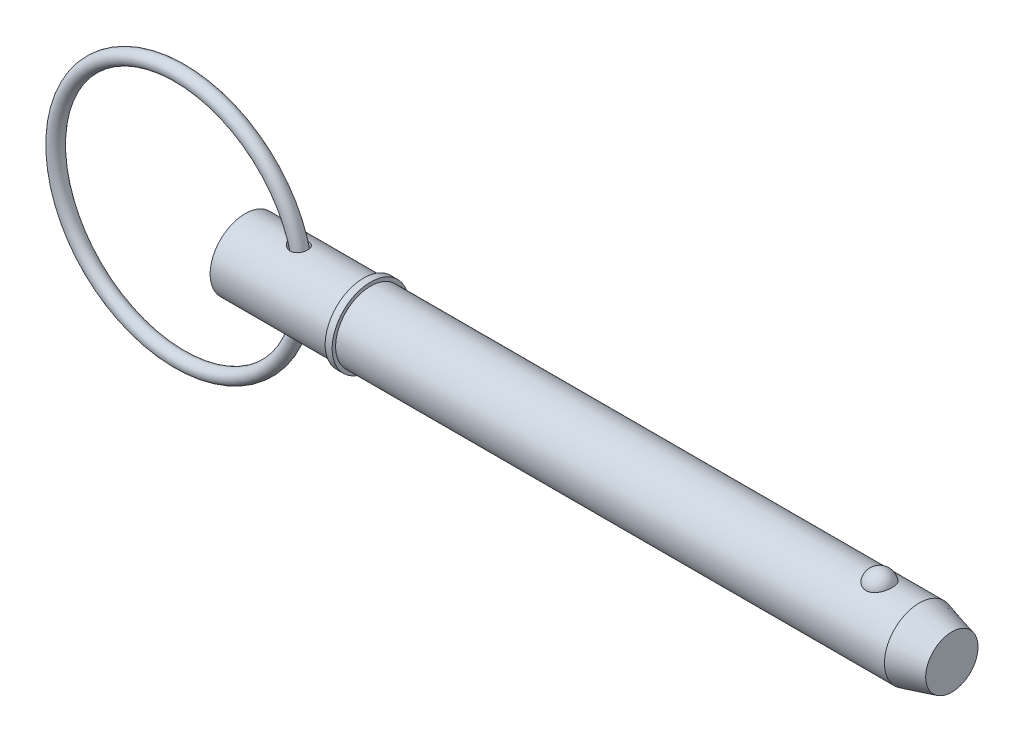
ISO-10303-21;
HEADER;
FILE_DESCRIPTION(('STEP AP214'),'2;1');
FILE_NAME('part.step','',(''),(''),'','','');
FILE_SCHEMA(('AUTOMOTIVE_DESIGN { 1 0 10303 214 1 1 1 1 }'));
ENDSEC;
DATA;
#1=APPLICATION_CONTEXT('core data for automotive mechanical design processes');
#2=APPLICATION_PROTOCOL_DEFINITION('international standard','automotive_design',2000,#1);
#3=PRODUCT_CONTEXT('',#1,'mechanical');
#4=PRODUCT('Part','Part','',(#3));
#5=PRODUCT_RELATED_PRODUCT_CATEGORY('part','',(#4));
#6=PRODUCT_DEFINITION_FORMATION('','',#4);
#7=PRODUCT_DEFINITION_CONTEXT('part definition',#1,'design');
#8=PRODUCT_DEFINITION('design','',#6,#7);
#9=PRODUCT_DEFINITION_SHAPE('','',#8);
#10=(LENGTH_UNIT() NAMED_UNIT(*) SI_UNIT(.MILLI.,.METRE.));
#11=(NAMED_UNIT(*) PLANE_ANGLE_UNIT() SI_UNIT($,.RADIAN.));
#12=(NAMED_UNIT(*) SI_UNIT($,.STERADIAN.) SOLID_ANGLE_UNIT());
#13=UNCERTAINTY_MEASURE_WITH_UNIT(LENGTH_MEASURE(1.E-05),#10,'distance_accuracy_value','');
#14=(GEOMETRIC_REPRESENTATION_CONTEXT(3) GLOBAL_UNCERTAINTY_ASSIGNED_CONTEXT((#13)) GLOBAL_UNIT_ASSIGNED_CONTEXT((#10,
#11,#12)) REPRESENTATION_CONTEXT('',''));
#15=CARTESIAN_POINT('',(0.,0.,0.));
#16=DIRECTION('',(0.,0.,1.));
#17=DIRECTION('',(1.,0.,0.));
#18=AXIS2_PLACEMENT_3D('',#15,#16,#17);
#19=CARTESIAN_POINT('',(-13.3805387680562,0.,0.));
#20=DIRECTION('',(0.,0.,1.));
#21=DIRECTION('',(1.,0.,0.));
#22=AXIS2_PLACEMENT_3D('',#19,#20,#21);
#23=TOROIDAL_SURFACE('',#22,25.4,1.429);
#24=CARTESIAN_POINT('',(13.4484612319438,0.,0.));
#25=VERTEX_POINT('',#24);
#26=VERTEX_LOOP('',#25);
#27=FACE_BOUND('',#26,.T.);
#28=ADVANCED_FACE('P0_F12',(#27),#23,.T.);
#29=CLOSED_SHELL('',(#28));
#30=MANIFOLD_SOLID_BREP('P0_B1',#29);
#31=CARTESIAN_POINT('',(0.,0.,0.));
#32=DIRECTION('',(1.,0.,0.));
#33=DIRECTION('',(0.,0.,-1.));
#34=AXIS2_PLACEMENT_3D('',#31,#32,#33);
#35=CYLINDRICAL_SURFACE('',#34,7.145);
#36=CARTESIAN_POINT('',(9.43029029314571,7.0820748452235,-0.94617170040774));
#37=CARTESIAN_POINT('',(9.49289741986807,7.07004660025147,-1.03619677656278));
#38=CARTESIAN_POINT('',(9.56370593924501,7.05703049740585,-1.12049617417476));
#39=CARTESIAN_POINT('',(9.71869321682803,7.03060933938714,-1.27585605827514));
#40=CARTESIAN_POINT('',(9.80290151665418,7.01720347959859,-1.34688652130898));
#41=CARTESIAN_POINT('',(9.98160385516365,6.99158714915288,-1.47408585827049));
#42=CARTESIAN_POINT('',(10.0760626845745,6.97937284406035,-1.53030346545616));
#43=CARTESIAN_POINT('',(10.2729508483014,6.95747410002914,-1.62697341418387));
#44=CARTESIAN_POINT('',(10.3753769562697,6.9477886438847,-1.66743209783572));
#45=CARTESIAN_POINT('',(10.5898946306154,6.93181594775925,-1.73266776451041));
#46=CARTESIAN_POINT('',(10.7022085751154,6.92567913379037,-1.75675727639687));
#47=CARTESIAN_POINT('',(10.9294935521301,6.91839634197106,-1.78523005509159));
#48=CARTESIAN_POINT('',(11.0444638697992,6.91724903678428,-1.78961856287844));
#49=CARTESIAN_POINT('',(11.2673249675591,6.92023954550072,-1.77801517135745));
#50=CARTESIAN_POINT('',(11.3752729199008,6.9241055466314,-1.7630715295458));
#51=CARTESIAN_POINT('',(11.5865707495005,6.93632220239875,-1.71437618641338));
#52=CARTESIAN_POINT('',(11.6899227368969,6.94467077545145,-1.68063321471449));
#53=CARTESIAN_POINT('',(11.8814537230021,6.96412118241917,-1.59802791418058));
#54=CARTESIAN_POINT('',(11.9701885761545,6.97498839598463,-1.55039425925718));
#55=CARTESIAN_POINT('',(12.1379548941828,6.99847346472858,-1.44066970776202));
#56=CARTESIAN_POINT('',(12.216987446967,7.01109112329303,-1.37858043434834));
#57=CARTESIAN_POINT('',(12.3614636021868,7.03632910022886,-1.24326778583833));
#58=CARTESIAN_POINT('',(12.4271729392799,7.04894297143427,-1.17032635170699));
#59=CARTESIAN_POINT('',(12.5455377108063,7.07306867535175,-1.01436746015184));
#60=CARTESIAN_POINT('',(12.5981928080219,7.08458047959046,-0.931349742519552));
#61=CARTESIAN_POINT('',(12.6896059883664,7.10535787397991,-0.756770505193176));
#62=CARTESIAN_POINT('',(12.7282356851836,7.11460247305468,-0.665139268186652));
#63=CARTESIAN_POINT('',(12.7900431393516,7.12971795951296,-0.476541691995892));
#64=CARTESIAN_POINT('',(12.8132203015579,7.13558871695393,-0.379575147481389));
#65=CARTESIAN_POINT('',(12.843715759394,7.14336270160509,-0.182249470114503));
#66=CARTESIAN_POINT('',(12.8509095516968,7.14523477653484,-0.081869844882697));
#67=CARTESIAN_POINT('',(12.8489064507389,7.14471772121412,0.118715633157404));
#68=CARTESIAN_POINT('',(12.8397092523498,7.14232851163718,0.218921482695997));
#69=CARTESIAN_POINT('',(12.8051110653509,7.13353949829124,0.41644658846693));
#70=CARTESIAN_POINT('',(12.7796895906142,7.12713462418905,0.513762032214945));
#71=CARTESIAN_POINT('',(12.7132079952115,7.1110024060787,0.702607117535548));
#72=CARTESIAN_POINT('',(12.6721476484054,7.10127501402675,0.79413667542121));
#73=CARTESIAN_POINT('',(12.5754142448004,7.07957648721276,0.968687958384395));
#74=CARTESIAN_POINT('',(12.5197583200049,7.06760798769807,1.05171950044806));
#75=CARTESIAN_POINT('',(12.3951873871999,7.04275315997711,1.20699878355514));
#76=CARTESIAN_POINT('',(12.3262733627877,7.02986689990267,1.27924732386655));
#77=CARTESIAN_POINT('',(12.1775943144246,7.00473797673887,1.41035599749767));
#78=CARTESIAN_POINT('',(12.0979195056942,6.99249102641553,1.46931758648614));
#79=CARTESIAN_POINT('',(11.9295314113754,6.96991222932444,1.57295053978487));
#80=CARTESIAN_POINT('',(11.840819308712,6.9595801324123,1.61762377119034));
#81=CARTESIAN_POINT('',(11.6577653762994,6.9420462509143,1.69128599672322));
#82=CARTESIAN_POINT('',(11.5634812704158,6.93481718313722,1.72041226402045));
#83=CARTESIAN_POINT('',(11.3712731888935,6.92407027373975,1.76316901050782));
#84=CARTESIAN_POINT('',(11.2733489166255,6.92055273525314,1.7767982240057));
#85=CARTESIAN_POINT('',(11.0745092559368,6.91745053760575,1.78883853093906));
#86=CARTESIAN_POINT('',(10.9735737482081,6.91794816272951,1.7869312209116));
#87=CARTESIAN_POINT('',(10.7732766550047,6.92286647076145,1.76777696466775));
#88=CARTESIAN_POINT('',(10.6739155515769,6.92728833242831,1.75052540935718));
#89=CARTESIAN_POINT('',(10.4726907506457,6.93987626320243,1.69995986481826));
#90=CARTESIAN_POINT('',(10.3710860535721,6.94826759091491,1.66567223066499));
#91=CARTESIAN_POINT('',(10.1746512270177,6.96783543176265,1.5818155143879));
#92=CARTESIAN_POINT('',(10.0798244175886,6.97901329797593,1.53223900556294));
#93=CARTESIAN_POINT('',(9.89353725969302,7.00369413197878,1.41530336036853));
#94=CARTESIAN_POINT('',(9.80266896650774,7.01729943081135,1.34701798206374));
#95=CARTESIAN_POINT('',(9.63408859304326,7.0446567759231,1.19571433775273));
#96=CARTESIAN_POINT('',(9.55637809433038,7.05840883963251,1.11269430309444));
#97=CARTESIAN_POINT('',(9.41909992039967,7.083998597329,0.935821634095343));
#98=CARTESIAN_POINT('',(9.35912834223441,7.09587546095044,0.842290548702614));
#99=CARTESIAN_POINT('',(9.25811978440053,7.11649414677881,0.645207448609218));
#100=CARTESIAN_POINT('',(9.21705789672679,7.12524008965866,0.541668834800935));
#101=CARTESIAN_POINT('',(9.16044503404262,7.13745944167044,0.341322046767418));
#102=CARTESIAN_POINT('',(9.14237352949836,7.14144984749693,0.245257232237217));
#103=CARTESIAN_POINT('',(9.12416132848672,7.14547143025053,0.0513577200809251));
#104=CARTESIAN_POINT('',(9.12401221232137,7.14550446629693,-0.0464761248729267));
#105=CARTESIAN_POINT('',(9.14075660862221,7.14180686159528,-0.230866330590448));
#106=CARTESIAN_POINT('',(9.15598246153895,7.13844450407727,-0.317588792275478));
#107=CARTESIAN_POINT('',(9.20015637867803,7.1288735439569,-0.487231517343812));
#108=CARTESIAN_POINT('',(9.22909411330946,7.12266708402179,-0.570154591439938));
#109=CARTESIAN_POINT('',(9.2869632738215,7.11060500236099,-0.702183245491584));
#110=CARTESIAN_POINT('',(9.3123377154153,7.10538970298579,-0.752949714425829));
#111=CARTESIAN_POINT('',(9.36784352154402,7.09422889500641,-0.851709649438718));
#112=CARTESIAN_POINT('',(9.39797435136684,7.08828346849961,-0.899703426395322));
#113=CARTESIAN_POINT('',(9.43029029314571,7.0820748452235,-0.94617170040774));
#114=B_SPLINE_CURVE_WITH_KNOTS('',3,(#36,#37,#38,#39,#40,#41,#42,#43,#44,#45,#46,#47,#48,#49,
#50,#51,#52,#53,#54,#55,#56,#57,#58,#59,#60,#61,#62,#63,#64,#65,#66,#67,#68,#69,#70,#71,#72,#73,
#74,#75,#76,#77,#78,#79,#80,#81,#82,#83,#84,#85,#86,#87,#88,#89,#90,#91,#92,#93,#94,#95,#96,#97,
#98,#99,#100,#101,#102,#103,#104,#105,#106,#107,#108,#109,#110,#111,#112,#113),.UNSPECIFIED.,
.T.,.F.,(4,2,2,2,2,2,2,2,2,2,2,2,2,2,2,2,2,2,2,2,2,2,2,2,2,2,2,2,2,2,2,2,2,2,2,2,2,2,4),(0.,
0.330712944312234,0.662165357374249,0.992513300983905,1.32272815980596,1.66607248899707,
2.00932547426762,2.33472339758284,2.65997034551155,2.96236844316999,3.26473260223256,
3.56029376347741,3.85586255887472,4.15407251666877,4.45229395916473,4.75283038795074,
5.05337241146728,5.35429467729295,5.6552212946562,5.95579625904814,6.25634893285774,
6.55452242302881,6.85265693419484,7.14811357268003,7.44359434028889,7.74514565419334,
8.04678757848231,8.36809025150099,8.68954924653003,9.03133562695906,9.37316306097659,
9.70647113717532,10.0393389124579,10.3311793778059,10.6228827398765,10.8860177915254,
11.1489549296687,11.3196783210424,11.4903825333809),.UNSPECIFIED.);
#115=CARTESIAN_POINT('',(9.43029029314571,7.0820748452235,-0.94617170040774));
#116=VERTEX_POINT('',#115);
#117=EDGE_CURVE('P1_E42',#116,#116,#114,.T.);
#118=ORIENTED_EDGE('',*,*,#117,.T.);
#119=EDGE_LOOP('',(#118));
#120=FACE_BOUND('',#119,.T.);
#121=CARTESIAN_POINT('',(0.,0.,0.));
#122=DIRECTION('',(1.,0.,0.));
#123=DIRECTION('',(0.,0.,-1.));
#124=AXIS2_PLACEMENT_3D('',#121,#122,#123);
#125=CIRCLE('',#124,7.145);
#126=CARTESIAN_POINT('',(0.,0.,-7.145));
#127=VERTEX_POINT('',#126);
#128=EDGE_CURVE('P1_E9',#127,#127,#125,.T.);
#129=ORIENTED_EDGE('',*,*,#128,.T.);
#130=EDGE_LOOP('',(#129));
#131=FACE_BOUND('',#130,.T.);
#132=CARTESIAN_POINT('',(24.271,0.,0.));
#133=DIRECTION('',(1.,0.,0.));
#134=DIRECTION('',(0.,0.,-1.));
#135=AXIS2_PLACEMENT_3D('',#132,#133,#134);
#136=CIRCLE('',#135,7.145);
#137=CARTESIAN_POINT('',(24.271,0.,-7.145));
#138=VERTEX_POINT('',#137);
#139=EDGE_CURVE('P1_E25',#138,#138,#136,.T.);
#140=ORIENTED_EDGE('',*,*,#139,.F.);
#141=EDGE_LOOP('',(#140));
#142=FACE_BOUND('',#141,.T.);
#143=CARTESIAN_POINT('',(9.43029029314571,-7.0820748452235,-0.94617170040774));
#144=CARTESIAN_POINT('',(9.37760063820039,-7.09219753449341,-0.870403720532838));
#145=CARTESIAN_POINT('',(9.33068640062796,-7.10162619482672,-0.790535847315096));
#146=CARTESIAN_POINT('',(9.25028000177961,-7.11818229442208,-0.624083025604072));
#147=CARTESIAN_POINT('',(9.21677847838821,-7.12531133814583,-0.53750281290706));
#148=CARTESIAN_POINT('',(9.16475883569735,-7.13651886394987,-0.359324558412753));
#149=CARTESIAN_POINT('',(9.14630423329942,-7.14058440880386,-0.267706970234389));
#150=CARTESIAN_POINT('',(9.12573334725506,-7.14512216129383,-0.082561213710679));
#151=CARTESIAN_POINT('',(9.12361335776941,-7.1455951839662,0.0109665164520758));
#152=CARTESIAN_POINT('',(9.13548667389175,-7.14296952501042,0.191627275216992));
#153=CARTESIAN_POINT('',(9.14858103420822,-7.14007009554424,0.278824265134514));
#154=CARTESIAN_POINT('',(9.18869656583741,-7.1313430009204,0.449782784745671));
#155=CARTESIAN_POINT('',(9.21571947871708,-7.1255149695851,0.533543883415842));
#156=CARTESIAN_POINT('',(9.282939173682,-7.11140544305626,0.696984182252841));
#157=CARTESIAN_POINT('',(9.32334793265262,-7.10308469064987,0.776572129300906));
#158=CARTESIAN_POINT('',(9.41555290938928,-7.08481187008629,0.928623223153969));
#159=CARTESIAN_POINT('',(9.4673531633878,-7.07485922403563,1.00108383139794));
#160=CARTESIAN_POINT('',(9.58690514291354,-7.05302654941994,1.14530893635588));
#161=CARTESIAN_POINT('',(9.65578345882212,-7.04105486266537,1.21612477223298));
#162=CARTESIAN_POINT('',(9.80342908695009,-7.01727063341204,1.34660507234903));
#163=CARTESIAN_POINT('',(9.88220203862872,-7.00545818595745,1.40626312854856));
#164=CARTESIAN_POINT('',(10.0573217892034,-6.9817739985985,1.51973713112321));
#165=CARTESIAN_POINT('',(10.1546474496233,-6.9700532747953,1.57208037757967));
#166=CARTESIAN_POINT('',(10.3567277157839,-6.94950828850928,1.66055104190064));
#167=CARTESIAN_POINT('',(10.4614845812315,-6.94068491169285,1.69667350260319));
#168=CARTESIAN_POINT('',(10.6792116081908,-6.92685379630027,1.75230777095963));
#169=CARTESIAN_POINT('',(10.7923373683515,-6.92197732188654,1.77125049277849));
#170=CARTESIAN_POINT('',(11.0202699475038,-6.91736328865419,1.78919210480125));
#171=CARTESIAN_POINT('',(11.1350759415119,-6.91762328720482,1.78820047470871));
#172=CARTESIAN_POINT('',(11.355627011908,-6.92328130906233,1.76615765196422));
#173=CARTESIAN_POINT('',(11.4615007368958,-6.92836826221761,1.74632083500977));
#174=CARTESIAN_POINT('',(11.6678083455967,-6.94272508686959,1.68833625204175));
#175=CARTESIAN_POINT('',(11.7682443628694,-6.9519933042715,1.65019572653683));
#176=CARTESIAN_POINT('',(11.9539217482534,-6.97285816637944,1.55957439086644));
#177=CARTESIAN_POINT('',(12.0397280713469,-6.98426147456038,1.50820229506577));
#178=CARTESIAN_POINT('',(12.2011249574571,-7.00842344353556,1.39160266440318));
#179=CARTESIAN_POINT('',(12.276716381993,-7.0211819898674,1.32637629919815));
#180=CARTESIAN_POINT('',(12.4144868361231,-7.04639315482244,1.18508369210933));
#181=CARTESIAN_POINT('',(12.4768620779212,-7.05884739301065,1.10920872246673));
#182=CARTESIAN_POINT('',(12.5881779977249,-7.08230185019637,0.947973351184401));
#183=CARTESIAN_POINT('',(12.6371182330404,-7.09330202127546,0.862612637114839));
#184=CARTESIAN_POINT('',(12.7208404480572,-7.11277016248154,0.683871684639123));
#185=CARTESIAN_POINT('',(12.7554736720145,-7.12121129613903,0.590418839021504));
#186=CARTESIAN_POINT('',(12.8090653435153,-7.13450309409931,0.398877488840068));
#187=CARTESIAN_POINT('',(12.8280232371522,-7.13935363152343,0.300788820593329));
#188=CARTESIAN_POINT('',(12.8499077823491,-7.14496695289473,0.102058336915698));
#189=CARTESIAN_POINT('',(12.8527265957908,-7.14570223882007,0.0014038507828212));
#190=CARTESIAN_POINT('',(12.8419792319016,-7.14293198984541,-0.198968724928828));
#191=CARTESIAN_POINT('',(12.8284127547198,-7.13942637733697,-0.298686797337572));
#192=CARTESIAN_POINT('',(12.7851853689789,-7.12854635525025,-0.494442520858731));
#193=CARTESIAN_POINT('',(12.7555107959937,-7.12116866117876,-0.590476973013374));
#194=CARTESIAN_POINT('',(12.6807437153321,-7.10334272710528,-0.776042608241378));
#195=CARTESIAN_POINT('',(12.6356510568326,-7.09289445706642,-0.865573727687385));
#196=CARTESIAN_POINT('',(12.5312128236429,-7.07009703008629,-1.03541867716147));
#197=CARTESIAN_POINT('',(12.4718917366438,-7.0577511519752,-1.11574799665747));
#198=CARTESIAN_POINT('',(12.3404461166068,-7.03252701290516,-1.26504204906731));
#199=CARTESIAN_POINT('',(12.2683227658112,-7.01964880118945,-1.33400783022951));
#200=CARTESIAN_POINT('',(12.1139052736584,-6.99493588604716,-1.45803732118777));
#201=CARTESIAN_POINT('',(12.031708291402,-6.98309284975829,-1.51322032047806));
#202=CARTESIAN_POINT('',(11.858962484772,-6.96164945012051,-1.60900039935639));
#203=CARTESIAN_POINT('',(11.7684146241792,-6.95204882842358,-1.6495991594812));
#204=CARTESIAN_POINT('',(11.5822744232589,-6.93618392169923,-1.71508374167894));
#205=CARTESIAN_POINT('',(11.4867225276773,-6.92989640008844,-1.74007923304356));
#206=CARTESIAN_POINT('',(11.292703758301,-6.92114809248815,-1.77455680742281));
#207=CARTESIAN_POINT('',(11.1942365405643,-6.91868775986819,-1.7840370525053));
#208=CARTESIAN_POINT('',(10.9943797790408,-6.91771041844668,-1.78782317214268));
#209=CARTESIAN_POINT('',(10.8929824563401,-6.9193005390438,-1.78171679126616));
#210=CARTESIAN_POINT('',(10.6924353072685,-6.92632816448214,-1.75419409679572));
#211=CARTESIAN_POINT('',(10.5932861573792,-6.93176681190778,-1.73277323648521));
#212=CARTESIAN_POINT('',(10.3927770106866,-6.94630717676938,-1.67356884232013));
#213=CARTESIAN_POINT('',(10.2917367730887,-6.95563581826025,-1.63475796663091));
#214=CARTESIAN_POINT('',(10.0971768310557,-6.97681957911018,-1.54184188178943));
#215=CARTESIAN_POINT('',(10.0036623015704,-6.9886764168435,-1.48772626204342));
#216=CARTESIAN_POINT('',(9.82098935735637,-7.01440230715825,-1.36146688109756));
#217=CARTESIAN_POINT('',(9.73247440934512,-7.0283510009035,-1.28840361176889));
#218=CARTESIAN_POINT('',(9.56978695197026,-7.05591334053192,-1.12770855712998));
#219=CARTESIAN_POINT('',(9.49560170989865,-7.06952727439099,-1.0400898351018));
#220=CARTESIAN_POINT('',(9.43029029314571,-7.0820748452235,-0.94617170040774));
#221=B_SPLINE_CURVE_WITH_KNOTS('',3,(#143,#144,#145,#146,#147,#148,#149,#150,#151,#152,#153,
#154,#155,#156,#157,#158,#159,#160,#161,#162,#163,#164,#165,#166,#167,#168,#169,#170,#171,#172,
#173,#174,#175,#176,#177,#178,#179,#180,#181,#182,#183,#184,#185,#186,#187,#188,#189,#190,#191,
#192,#193,#194,#195,#196,#197,#198,#199,#200,#201,#202,#203,#204,#205,#206,#207,#208,#209,#210,
#211,#212,#213,#214,#215,#216,#217,#218,#219,#220),.UNSPECIFIED.,.T.,.F.,(4,2,2,2,2,2,2,2,2,2,2,
2,2,2,2,2,2,2,2,2,2,2,2,2,2,2,2,2,2,2,2,2,2,2,2,2,2,2,4),(0.,0.278197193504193,
0.556199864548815,0.835370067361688,1.11447693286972,1.37789669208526,1.64134939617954,
1.90919123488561,2.17712812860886,2.47446254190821,2.77196719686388,3.10386520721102,
3.43586457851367,3.77849767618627,4.1209678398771,4.44276705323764,4.76443907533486,
5.0649452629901,5.36542609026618,5.66107282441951,5.95672929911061,6.25538683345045,
6.5540549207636,6.85471634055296,7.15538326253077,7.45630563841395,7.75723095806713,
8.05764204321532,8.35802540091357,8.65571107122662,8.95336242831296,9.24889743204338,
9.54446744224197,9.84793560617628,10.1514939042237,10.4760045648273,10.8007364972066,
11.1458836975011,11.4907227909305),.UNSPECIFIED.);
#222=CARTESIAN_POINT('',(9.43029029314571,-7.0820748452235,-0.94617170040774));
#223=VERTEX_POINT('',#222);
#224=EDGE_CURVE('P1_E17',#223,#223,#221,.T.);
#225=ORIENTED_EDGE('',*,*,#224,.T.);
#226=EDGE_LOOP('',(#225));
#227=FACE_BOUND('',#226,.T.);
#228=ADVANCED_FACE('P1_F13',(#120,#131,#142,#227),#35,.T.);
#229=CARTESIAN_POINT('',(0.,0.,0.));
#230=DIRECTION('',(1.,0.,0.));
#231=DIRECTION('',(0.,0.,-1.));
#232=AXIS2_PLACEMENT_3D('',#229,#230,#231);
#233=CYLINDRICAL_SURFACE('',#232,7.145);
#234=CARTESIAN_POINT('',(138.08362424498,0.,0.));
#235=DIRECTION('',(1.,0.,0.));
#236=DIRECTION('',(0.,0.,-1.));
#237=AXIS2_PLACEMENT_3D('',#234,#235,#236);
#238=CIRCLE('',#237,7.145);
#239=CARTESIAN_POINT('',(138.08362424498,0.,-7.145));
#240=VERTEX_POINT('',#239);
#241=EDGE_CURVE('P1_E99',#240,#240,#238,.T.);
#242=ORIENTED_EDGE('',*,*,#241,.F.);
#243=EDGE_LOOP('',(#242));
#244=FACE_BOUND('',#243,.T.);
#245=CARTESIAN_POINT('',(25.7,0.,0.));
#246=DIRECTION('',(1.,0.,0.));
#247=DIRECTION('',(0.,0.,-1.));
#248=AXIS2_PLACEMENT_3D('',#245,#246,#247);
#249=CIRCLE('',#248,7.145);
#250=CARTESIAN_POINT('',(25.7,0.,-7.145));
#251=VERTEX_POINT('',#250);
#252=EDGE_CURVE('P1_E96',#251,#251,#249,.T.);
#253=ORIENTED_EDGE('',*,*,#252,.T.);
#254=EDGE_LOOP('',(#253));
#255=FACE_BOUND('',#254,.T.);
#256=CARTESIAN_POINT('',(129.939503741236,6.6032862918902,2.72903557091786));
#257=CARTESIAN_POINT('',(129.798315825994,6.60329644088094,2.72902496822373));
#258=CARTESIAN_POINT('',(129.656883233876,6.60799490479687,2.71772840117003));
#259=CARTESIAN_POINT('',(129.377955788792,6.62628236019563,2.67281935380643));
#260=CARTESIAN_POINT('',(129.240472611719,6.63989534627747,2.63914664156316));
#261=CARTESIAN_POINT('',(128.973889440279,6.67440775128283,2.5505964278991));
#262=CARTESIAN_POINT('',(128.844768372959,6.69528793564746,2.49577486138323));
#263=CARTESIAN_POINT('',(128.597869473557,6.74205585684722,2.36651799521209));
#264=CARTESIAN_POINT('',(128.480086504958,6.76794130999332,2.29209163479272));
#265=CARTESIAN_POINT('',(128.25516710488,6.82286177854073,2.1231293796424));
#266=CARTESIAN_POINT('',(128.148440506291,6.85196655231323,2.02807107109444));
#267=CARTESIAN_POINT('',(127.951918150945,6.90970232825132,1.82167822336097));
#268=CARTESIAN_POINT('',(127.862127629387,6.93833318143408,1.71033867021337));
#269=CARTESIAN_POINT('',(127.697667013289,6.99351679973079,1.46891951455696));
#270=CARTESIAN_POINT('',(127.623844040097,7.01992110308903,1.33822781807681));
#271=CARTESIAN_POINT('',(127.498088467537,7.06643385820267,1.06566567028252));
#272=CARTESIAN_POINT('',(127.44615735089,7.08654188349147,0.923794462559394));
#273=CARTESIAN_POINT('',(127.364732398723,7.11862399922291,0.630993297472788));
#274=CARTESIAN_POINT('',(127.335516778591,7.13049704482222,0.479974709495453));
#275=CARTESIAN_POINT('',(127.301174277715,7.14449484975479,0.174782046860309));
#276=CARTESIAN_POINT('',(127.296046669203,7.14661990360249,0.0206080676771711));
#277=CARTESIAN_POINT('',(127.309938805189,7.14092465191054,-0.285506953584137));
#278=CARTESIAN_POINT('',(127.328810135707,7.1331654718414,-0.437455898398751));
#279=CARTESIAN_POINT('',(127.390062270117,7.10859076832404,-0.735778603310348));
#280=CARTESIAN_POINT('',(127.432443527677,7.0917750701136,-0.882152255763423));
#281=CARTESIAN_POINT('',(127.539934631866,7.05076716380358,-1.165431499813));
#282=CARTESIAN_POINT('',(127.605075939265,7.02656475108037,-1.30232366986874));
#283=CARTESIAN_POINT('',(127.756759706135,6.97329145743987,-1.56265907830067));
#284=CARTESIAN_POINT('',(127.843303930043,6.94422017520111,-1.68610120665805));
#285=CARTESIAN_POINT('',(128.036465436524,6.88415108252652,-1.91671004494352));
#286=CARTESIAN_POINT('',(128.143180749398,6.85314438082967,-2.02379244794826));
#287=CARTESIAN_POINT('',(128.373974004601,6.79282069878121,-2.21787433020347));
#288=CARTESIAN_POINT('',(128.498050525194,6.76350358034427,-2.30487545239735));
#289=CARTESIAN_POINT('',(128.757678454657,6.71060580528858,-2.45458647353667));
#290=CARTESIAN_POINT('',(128.892938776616,6.68691885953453,-2.51776240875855));
#291=CARTESIAN_POINT('',(129.173277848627,6.64741247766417,-2.62030218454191));
#292=CARTESIAN_POINT('',(129.318352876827,6.63159007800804,-2.65967499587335));
#293=CARTESIAN_POINT('',(129.606347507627,6.61038594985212,-2.71193301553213));
#294=CARTESIAN_POINT('',(129.74900807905,6.60451880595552,-2.72605165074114));
#295=CARTESIAN_POINT('',(130.034800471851,6.60240611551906,-2.73116688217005));
#296=CARTESIAN_POINT('',(130.177932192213,6.60615862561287,-2.72216814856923));
#297=CARTESIAN_POINT('',(130.455848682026,6.62256094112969,-2.68200435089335));
#298=CARTESIAN_POINT('',(130.590754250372,6.63492533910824,-2.65154998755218));
#299=CARTESIAN_POINT('',(130.85332009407,6.66687445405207,-2.57015684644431));
#300=CARTESIAN_POINT('',(130.98097978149,6.68645975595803,-2.51921640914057));
#301=CARTESIAN_POINT('',(131.228577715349,6.731272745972,-2.39693610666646));
#302=CARTESIAN_POINT('',(131.348287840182,6.75661381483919,-2.32517694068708));
#303=CARTESIAN_POINT('',(131.574159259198,6.8100600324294,-2.16363812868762));
#304=CARTESIAN_POINT('',(131.680317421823,6.83816581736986,-2.07385432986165));
#305=CARTESIAN_POINT('',(131.881862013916,6.89580469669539,-1.87357235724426));
#306=CARTESIAN_POINT('',(131.976440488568,6.92533863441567,-1.76226074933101));
#307=CARTESIAN_POINT('',(132.146332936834,6.98139526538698,-1.52511696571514));
#308=CARTESIAN_POINT('',(132.221643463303,7.0079174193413,-1.39928219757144));
#309=CARTESIAN_POINT('',(132.353595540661,7.05607625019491,-1.13215977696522));
#310=CARTESIAN_POINT('',(132.409568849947,7.07753119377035,-0.990508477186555));
#311=CARTESIAN_POINT('',(132.498296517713,7.11222355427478,-0.699154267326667));
#312=CARTESIAN_POINT('',(132.531050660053,7.12546089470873,-0.549451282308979));
#313=CARTESIAN_POINT('',(132.572689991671,7.14237584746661,-0.246120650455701));
#314=CARTESIAN_POINT('',(132.581558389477,7.14604673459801,-0.0924903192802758));
#315=CARTESIAN_POINT('',(132.57519405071,7.14343510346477,0.214181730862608));
#316=CARTESIAN_POINT('',(132.559961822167,7.13715279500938,0.367223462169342));
#317=CARTESIAN_POINT('',(132.505845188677,7.11532948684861,0.667595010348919));
#318=CARTESIAN_POINT('',(132.467077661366,7.09983424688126,0.814949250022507));
#319=CARTESIAN_POINT('',(132.366770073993,7.06119140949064,1.10063221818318));
#320=CARTESIAN_POINT('',(132.305228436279,7.03804328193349,1.238960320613));
#321=CARTESIAN_POINT('',(132.160207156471,6.98632429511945,1.50352300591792));
#322=CARTESIAN_POINT('',(132.076606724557,6.95772382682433,1.62968561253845));
#323=CARTESIAN_POINT('',(131.88938046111,6.89823072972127,1.86554304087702));
#324=CARTESIAN_POINT('',(131.785755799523,6.86733823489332,1.97523882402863));
#325=CARTESIAN_POINT('',(131.561076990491,6.80676456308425,2.17482293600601));
#326=CARTESIAN_POINT('',(131.440067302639,6.77708053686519,2.26476035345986));
#327=CARTESIAN_POINT('',(131.183340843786,6.72230501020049,2.42252989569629));
#328=CARTESIAN_POINT('',(131.04761851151,6.69721525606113,2.49035362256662));
#329=CARTESIAN_POINT('',(130.770402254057,6.65552591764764,2.59967646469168));
#330=CARTESIAN_POINT('',(130.629281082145,6.63865794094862,2.64202017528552));
#331=CARTESIAN_POINT('',(130.341444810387,6.6142503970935,2.70255841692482));
#332=CARTESIAN_POINT('',(130.194748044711,6.60668259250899,2.72082606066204));
#333=CARTESIAN_POINT('',(130.011679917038,6.60358754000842,2.7283033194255));
#334=CARTESIAN_POINT('',(129.975599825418,6.60328369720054,2.72903828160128));
#335=CARTESIAN_POINT('',(129.939503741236,6.6032862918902,2.72903557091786));
#336=B_SPLINE_CURVE_WITH_KNOTS('',3,(#256,#257,#258,#259,#260,#261,#262,#263,#264,#265,#266,
#267,#268,#269,#270,#271,#272,#273,#274,#275,#276,#277,#278,#279,#280,#281,#282,#283,#284,#285,
#286,#287,#288,#289,#290,#291,#292,#293,#294,#295,#296,#297,#298,#299,#300,#301,#302,#303,#304,
#305,#306,#307,#308,#309,#310,#311,#312,#313,#314,#315,#316,#317,#318,#319,#320,#321,#322,#323,
#324,#325,#326,#327,#328,#329,#330,#331,#332,#333,#334,#335),.UNSPECIFIED.,.T.,.F.,(4,2,2,2,2,2,
2,2,2,2,2,2,2,2,2,2,2,2,2,2,2,2,2,2,2,2,2,2,2,2,2,2,2,2,2,2,2,2,2,4),(0.,0.423468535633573,
0.848081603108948,1.27157926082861,1.69488414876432,2.13051395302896,2.56627819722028,
3.02136706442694,3.47648674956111,3.93709649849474,4.3976923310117,4.85545355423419,
5.31322361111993,5.77162895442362,6.23007210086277,6.69080337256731,7.15149693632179,
7.60264329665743,8.05361952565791,8.48189729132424,8.91008854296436,9.32472524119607,
9.73939553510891,10.1630783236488,10.5868588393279,11.031907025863,11.4770347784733,
11.9362874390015,12.3955443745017,12.8551240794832,13.3146940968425,13.7720003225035,
14.2293382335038,14.6892343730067,15.1491036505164,15.6078171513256,16.0667046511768,
16.5093965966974,16.9507410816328,17.0590049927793),.UNSPECIFIED.);
#337=CARTESIAN_POINT('',(129.939503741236,6.6032862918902,2.72903557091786));
#338=VERTEX_POINT('',#337);
#339=EDGE_CURVE('P1_E34',#338,#338,#336,.T.);
#340=ORIENTED_EDGE('',*,*,#339,.T.);
#341=EDGE_LOOP('',(#340));
#342=FACE_BOUND('',#341,.T.);
#343=ADVANCED_FACE('P1_F46',(#244,#255,#342),#233,.T.);
#344=CARTESIAN_POINT('',(0.,0.,0.));
#345=DIRECTION('',(-1.,0.,0.));
#346=DIRECTION('',(0.,0.,1.));
#347=AXIS2_PLACEMENT_3D('',#344,#345,#346);
#348=PLANE('',#347);
#349=ORIENTED_EDGE('',*,*,#128,.F.);
#350=EDGE_LOOP('',(#349));
#351=FACE_BOUND('',#350,.T.);
#352=ADVANCED_FACE('P1_F15',(#351),#348,.T.);
#353=CARTESIAN_POINT('',(24.271,7.145,0.));
#354=DIRECTION('',(-1.,0.,0.));
#355=DIRECTION('',(0.,0.,1.));
#356=AXIS2_PLACEMENT_3D('',#353,#354,#355);
#357=PLANE('',#356);
#358=ORIENTED_EDGE('',*,*,#139,.T.);
#359=EDGE_LOOP('',(#358));
#360=FACE_BOUND('',#359,.T.);
#361=CARTESIAN_POINT('',(24.271,0.,0.));
#362=DIRECTION('',(1.,0.,0.));
#363=DIRECTION('',(0.,0.,-1.));
#364=AXIS2_PLACEMENT_3D('',#361,#362,#363);
#365=CIRCLE('',#364,7.8595);
#366=CARTESIAN_POINT('',(24.271,0.,-7.8595));
#367=VERTEX_POINT('',#366);
#368=EDGE_CURVE('P1_E30',#367,#367,#365,.T.);
#369=ORIENTED_EDGE('',*,*,#368,.F.);
#370=EDGE_LOOP('',(#369));
#371=FACE_BOUND('',#370,.T.);
#372=ADVANCED_FACE('P1_F81',(#360,#371),#357,.T.);
#373=CARTESIAN_POINT('',(0.,0.,0.));
#374=DIRECTION('',(1.,0.,0.));
#375=DIRECTION('',(0.,0.,-1.));
#376=AXIS2_PLACEMENT_3D('',#373,#374,#375);
#377=CYLINDRICAL_SURFACE('',#376,7.8595);
#378=ORIENTED_EDGE('',*,*,#368,.T.);
#379=EDGE_LOOP('',(#378));
#380=FACE_BOUND('',#379,.T.);
#381=CARTESIAN_POINT('',(25.7,0.,0.));
#382=DIRECTION('',(1.,0.,0.));
#383=DIRECTION('',(0.,0.,-1.));
#384=AXIS2_PLACEMENT_3D('',#381,#382,#383);
#385=CIRCLE('',#384,7.8595);
#386=CARTESIAN_POINT('',(25.7,0.,-7.8595));
#387=VERTEX_POINT('',#386);
#388=EDGE_CURVE('P1_E95',#387,#387,#385,.T.);
#389=ORIENTED_EDGE('',*,*,#388,.F.);
#390=EDGE_LOOP('',(#389));
#391=FACE_BOUND('',#390,.T.);
#392=ADVANCED_FACE('P1_F68',(#380,#391),#377,.T.);
#393=CARTESIAN_POINT('',(25.7,7.8595,0.));
#394=DIRECTION('',(1.,0.,0.));
#395=DIRECTION('',(0.,0.,-1.));
#396=AXIS2_PLACEMENT_3D('',#393,#394,#395);
#397=PLANE('',#396);
#398=ORIENTED_EDGE('',*,*,#388,.T.);
#399=EDGE_LOOP('',(#398));
#400=FACE_BOUND('',#399,.T.);
#401=ORIENTED_EDGE('',*,*,#252,.F.);
#402=EDGE_LOOP('',(#401));
#403=FACE_BOUND('',#402,.T.);
#404=ADVANCED_FACE('P1_F62',(#400,#403),#397,.T.);
#405=CARTESIAN_POINT('',(144.75,0.,0.));
#406=DIRECTION('',(-1.,0.,0.));
#407=DIRECTION('',(0.,0.,1.));
#408=AXIS2_PLACEMENT_3D('',#405,#406,#407);
#409=CONICAL_SURFACE('',#408,5.35875000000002,0.261799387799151);
#410=ORIENTED_EDGE('',*,*,#241,.T.);
#411=EDGE_LOOP('',(#410));
#412=FACE_BOUND('',#411,.T.);
#413=CARTESIAN_POINT('',(144.75,0.,0.));
#414=DIRECTION('',(1.,0.,0.));
#415=DIRECTION('',(0.,0.,-1.));
#416=AXIS2_PLACEMENT_3D('',#413,#414,#415);
#417=CIRCLE('',#416,5.35875000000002);
#418=CARTESIAN_POINT('',(144.75,0.,-5.35875000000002));
#419=VERTEX_POINT('',#418);
#420=EDGE_CURVE('P1_E41',#419,#419,#417,.T.);
#421=ORIENTED_EDGE('',*,*,#420,.F.);
#422=EDGE_LOOP('',(#421));
#423=FACE_BOUND('',#422,.T.);
#424=ADVANCED_FACE('P1_F59',(#412,#423),#409,.T.);
#425=CARTESIAN_POINT('',(144.75,5.35875000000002,0.));
#426=DIRECTION('',(1.,0.,0.));
#427=DIRECTION('',(0.,0.,-1.));
#428=AXIS2_PLACEMENT_3D('',#425,#426,#427);
#429=PLANE('',#428);
#430=ORIENTED_EDGE('',*,*,#420,.T.);
#431=EDGE_LOOP('',(#430));
#432=FACE_BOUND('',#431,.T.);
#433=ADVANCED_FACE('P1_F55',(#432),#429,.T.);
#434=CARTESIAN_POINT('',(129.939503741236,6.43049999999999,0.));
#435=DIRECTION('',(-1.,0.,0.));
#436=DIRECTION('',(0.,1.,0.));
#437=AXIS2_PLACEMENT_3D('',#434,#435,#436);
#438=SPHERICAL_SURFACE('',#437,2.73450000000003);
#439=ORIENTED_EDGE('',*,*,#339,.F.);
#440=EDGE_LOOP('',(#439));
#441=FACE_BOUND('',#440,.T.);
#442=ADVANCED_FACE('P1_F50',(#441),#438,.T.);
#443=CARTESIAN_POINT('',(-13.3805387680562,0.,0.));
#444=DIRECTION('',(0.,0.,1.));
#445=DIRECTION('',(1.,0.,0.));
#446=AXIS2_PLACEMENT_3D('',#443,#444,#445);
#447=TOROIDAL_SURFACE('',#446,25.4,1.78625);
#448=ORIENTED_EDGE('',*,*,#224,.F.);
#449=EDGE_LOOP('',(#448));
#450=FACE_BOUND('',#449,.T.);
#451=ORIENTED_EDGE('',*,*,#117,.F.);
#452=EDGE_LOOP('',(#451));
#453=FACE_BOUND('',#452,.T.);
#454=ADVANCED_FACE('P1_F54',(#450,#453),#447,.F.);
#455=CLOSED_SHELL('',(#228,#343,#352,#372,#392,#404,#424,#433,#442,#454));
#456=MANIFOLD_SOLID_BREP('P1_B1',#455);
#457=ADVANCED_BREP_SHAPE_REPRESENTATION('',(#18,#30,#456),#14);
#458=SHAPE_DEFINITION_REPRESENTATION(#9,#457);
ENDSEC;
END-ISO-10303-21;
